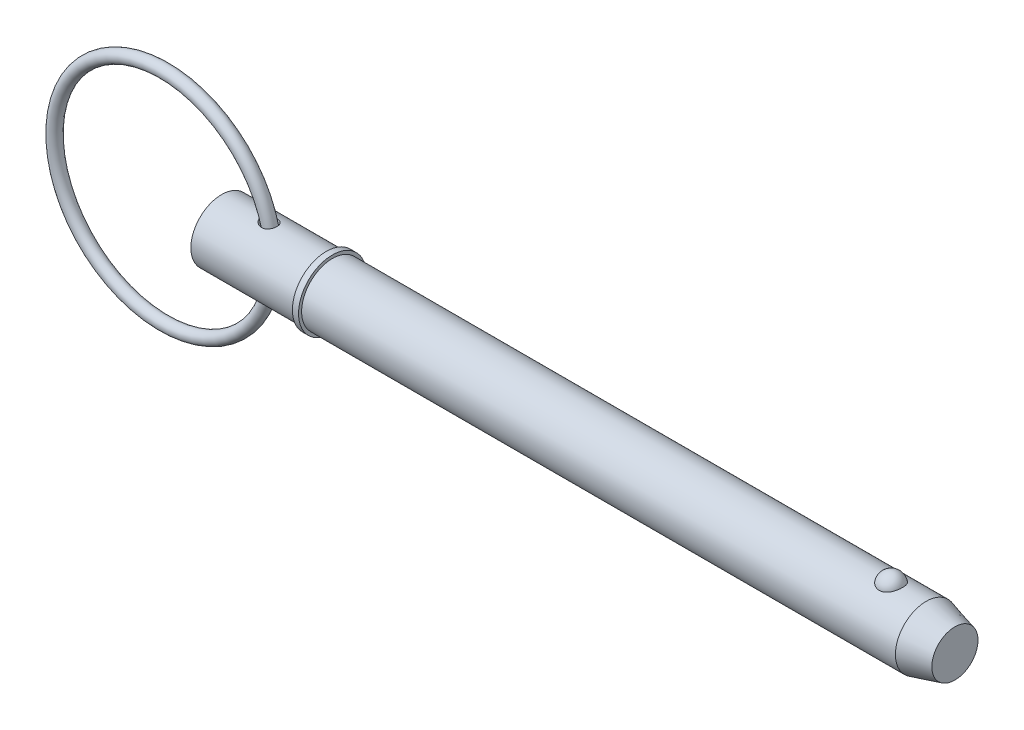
ISO-10303-21;
HEADER;
FILE_DESCRIPTION(('STEP AP214'),'2;1');
FILE_NAME('part.step','',(''),(''),'','','');
FILE_SCHEMA(('AUTOMOTIVE_DESIGN { 1 0 10303 214 1 1 1 1 }'));
ENDSEC;
DATA;
#1=APPLICATION_CONTEXT('core data for automotive mechanical design processes');
#2=APPLICATION_PROTOCOL_DEFINITION('international standard','automotive_design',2000,#1);
#3=PRODUCT_CONTEXT('',#1,'mechanical');
#4=PRODUCT('Part','Part','',(#3));
#5=PRODUCT_RELATED_PRODUCT_CATEGORY('part','',(#4));
#6=PRODUCT_DEFINITION_FORMATION('','',#4);
#7=PRODUCT_DEFINITION_CONTEXT('part definition',#1,'design');
#8=PRODUCT_DEFINITION('design','',#6,#7);
#9=PRODUCT_DEFINITION_SHAPE('','',#8);
#10=(LENGTH_UNIT() NAMED_UNIT(*) SI_UNIT(.MILLI.,.METRE.));
#11=(NAMED_UNIT(*) PLANE_ANGLE_UNIT() SI_UNIT($,.RADIAN.));
#12=(NAMED_UNIT(*) SI_UNIT($,.STERADIAN.) SOLID_ANGLE_UNIT());
#13=UNCERTAINTY_MEASURE_WITH_UNIT(LENGTH_MEASURE(1.E-05),#10,'distance_accuracy_value','');
#14=(GEOMETRIC_REPRESENTATION_CONTEXT(3) GLOBAL_UNCERTAINTY_ASSIGNED_CONTEXT((#13)) GLOBAL_UNIT_ASSIGNED_CONTEXT((#10,
#11,#12)) REPRESENTATION_CONTEXT('',''));
#15=CARTESIAN_POINT('',(0.,0.,0.));
#16=DIRECTION('',(0.,0.,1.));
#17=DIRECTION('',(1.,0.,0.));
#18=AXIS2_PLACEMENT_3D('',#15,#16,#17);
#19=CARTESIAN_POINT('',(-13.3805387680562,0.,0.));
#20=DIRECTION('',(0.,0.,1.));
#21=DIRECTION('',(1.,0.,0.));
#22=AXIS2_PLACEMENT_3D('',#19,#20,#21);
#23=TOROIDAL_SURFACE('',#22,25.4,1.429);
#24=CARTESIAN_POINT('',(13.4484612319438,0.,0.));
#25=VERTEX_POINT('',#24);
#26=VERTEX_LOOP('',#25);
#27=FACE_BOUND('',#26,.T.);
#28=ADVANCED_FACE('P0_F12',(#27),#23,.T.);
#29=CLOSED_SHELL('',(#28));
#30=MANIFOLD_SOLID_BREP('P0_B1',#29);
#31=CARTESIAN_POINT('',(0.,0.,0.));
#32=DIRECTION('',(1.,0.,0.));
#33=DIRECTION('',(0.,0.,-1.));
#34=AXIS2_PLACEMENT_3D('',#31,#32,#33);
#35=CYLINDRICAL_SURFACE('',#34,7.145);
#36=CARTESIAN_POINT('',(9.43029029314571,7.0820748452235,-0.946171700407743));
#37=CARTESIAN_POINT('',(9.49289741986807,7.07004660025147,-1.03619677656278));
#38=CARTESIAN_POINT('',(9.56370593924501,7.05703049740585,-1.12049617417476));
#39=CARTESIAN_POINT('',(9.71869321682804,7.03060933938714,-1.27585605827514));
#40=CARTESIAN_POINT('',(9.80290151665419,7.01720347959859,-1.34688652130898));
#41=CARTESIAN_POINT('',(9.98160385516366,6.99158714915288,-1.47408585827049));
#42=CARTESIAN_POINT('',(10.0760626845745,6.97937284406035,-1.53030346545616));
#43=CARTESIAN_POINT('',(10.2729508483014,6.95747410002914,-1.62697341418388));
#44=CARTESIAN_POINT('',(10.3753769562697,6.9477886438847,-1.66743209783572));
#45=CARTESIAN_POINT('',(10.5898946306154,6.93181594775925,-1.73266776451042));
#46=CARTESIAN_POINT('',(10.7022085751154,6.92567913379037,-1.75675727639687));
#47=CARTESIAN_POINT('',(10.9294935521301,6.91839634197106,-1.78523005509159));
#48=CARTESIAN_POINT('',(11.0444638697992,6.91724903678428,-1.78961856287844));
#49=CARTESIAN_POINT('',(11.2673249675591,6.92023954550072,-1.77801517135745));
#50=CARTESIAN_POINT('',(11.3752729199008,6.9241055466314,-1.7630715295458));
#51=CARTESIAN_POINT('',(11.5865707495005,6.93632220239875,-1.71437618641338));
#52=CARTESIAN_POINT('',(11.6899227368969,6.94467077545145,-1.68063321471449));
#53=CARTESIAN_POINT('',(11.8814537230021,6.96412118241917,-1.59802791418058));
#54=CARTESIAN_POINT('',(11.9701885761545,6.97498839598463,-1.55039425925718));
#55=CARTESIAN_POINT('',(12.1379548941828,6.99847346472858,-1.44066970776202));
#56=CARTESIAN_POINT('',(12.216987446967,7.01109112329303,-1.37858043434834));
#57=CARTESIAN_POINT('',(12.3614636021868,7.03632910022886,-1.24326778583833));
#58=CARTESIAN_POINT('',(12.4271729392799,7.04894297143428,-1.17032635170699));
#59=CARTESIAN_POINT('',(12.5455377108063,7.07306867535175,-1.01436746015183));
#60=CARTESIAN_POINT('',(12.5981928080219,7.08458047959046,-0.931349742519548));
#61=CARTESIAN_POINT('',(12.6896059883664,7.10535787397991,-0.75677050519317));
#62=CARTESIAN_POINT('',(12.7282356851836,7.11460247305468,-0.665139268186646));
#63=CARTESIAN_POINT('',(12.7900431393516,7.12971795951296,-0.476541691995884));
#64=CARTESIAN_POINT('',(12.8132203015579,7.13558871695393,-0.379575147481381));
#65=CARTESIAN_POINT('',(12.843715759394,7.14336270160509,-0.182249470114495));
#66=CARTESIAN_POINT('',(12.8509095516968,7.14523477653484,-0.0818698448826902));
#67=CARTESIAN_POINT('',(12.8489064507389,7.14471772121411,0.11871563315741));
#68=CARTESIAN_POINT('',(12.8397092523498,7.14232851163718,0.218921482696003));
#69=CARTESIAN_POINT('',(12.8051110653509,7.13353949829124,0.416446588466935));
#70=CARTESIAN_POINT('',(12.7796895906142,7.12713462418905,0.51376203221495));
#71=CARTESIAN_POINT('',(12.7132079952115,7.1110024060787,0.702607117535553));
#72=CARTESIAN_POINT('',(12.6721476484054,7.10127501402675,0.794136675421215));
#73=CARTESIAN_POINT('',(12.5754142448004,7.07957648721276,0.9686879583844));
#74=CARTESIAN_POINT('',(12.5197583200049,7.06760798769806,1.05171950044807));
#75=CARTESIAN_POINT('',(12.3951873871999,7.04275315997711,1.20699878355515));
#76=CARTESIAN_POINT('',(12.3262733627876,7.02986689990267,1.27924732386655));
#77=CARTESIAN_POINT('',(12.1775943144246,7.00473797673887,1.41035599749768));
#78=CARTESIAN_POINT('',(12.0979195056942,6.99249102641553,1.46931758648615));
#79=CARTESIAN_POINT('',(11.9295314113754,6.96991222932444,1.57295053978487));
#80=CARTESIAN_POINT('',(11.840819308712,6.9595801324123,1.61762377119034));
#81=CARTESIAN_POINT('',(11.6577653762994,6.94204625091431,1.69128599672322));
#82=CARTESIAN_POINT('',(11.5634812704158,6.93481718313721,1.72041226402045));
#83=CARTESIAN_POINT('',(11.3712731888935,6.92407027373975,1.76316901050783));
#84=CARTESIAN_POINT('',(11.2733489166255,6.92055273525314,1.7767982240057));
#85=CARTESIAN_POINT('',(11.0745092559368,6.91745053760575,1.78883853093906));
#86=CARTESIAN_POINT('',(10.9735737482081,6.91794816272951,1.7869312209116));
#87=CARTESIAN_POINT('',(10.7732766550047,6.92286647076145,1.76777696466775));
#88=CARTESIAN_POINT('',(10.6739155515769,6.92728833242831,1.75052540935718));
#89=CARTESIAN_POINT('',(10.4726907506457,6.93987626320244,1.69995986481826));
#90=CARTESIAN_POINT('',(10.3710860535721,6.94826759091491,1.66567223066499));
#91=CARTESIAN_POINT('',(10.1746512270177,6.96783543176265,1.5818155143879));
#92=CARTESIAN_POINT('',(10.0798244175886,6.97901329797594,1.53223900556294));
#93=CARTESIAN_POINT('',(9.89353725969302,7.00369413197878,1.41530336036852));
#94=CARTESIAN_POINT('',(9.80266896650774,7.01729943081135,1.34701798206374));
#95=CARTESIAN_POINT('',(9.63408859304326,7.0446567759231,1.19571433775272));
#96=CARTESIAN_POINT('',(9.55637809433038,7.05840883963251,1.11269430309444));
#97=CARTESIAN_POINT('',(9.41909992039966,7.083998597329,0.935821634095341));
#98=CARTESIAN_POINT('',(9.3591283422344,7.09587546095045,0.842290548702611));
#99=CARTESIAN_POINT('',(9.25811978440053,7.11649414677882,0.645207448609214));
#100=CARTESIAN_POINT('',(9.2170578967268,7.12524008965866,0.541668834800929));
#101=CARTESIAN_POINT('',(9.16044503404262,7.13745944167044,0.341322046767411));
#102=CARTESIAN_POINT('',(9.14237352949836,7.14144984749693,0.24525723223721));
#103=CARTESIAN_POINT('',(9.12416132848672,7.14547143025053,0.0513577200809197));
#104=CARTESIAN_POINT('',(9.12401221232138,7.14550446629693,-0.0464761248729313));
#105=CARTESIAN_POINT('',(9.14075660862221,7.14180686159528,-0.230866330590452));
#106=CARTESIAN_POINT('',(9.15598246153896,7.13844450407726,-0.317588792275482));
#107=CARTESIAN_POINT('',(9.20015637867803,7.1288735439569,-0.487231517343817));
#108=CARTESIAN_POINT('',(9.22909411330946,7.12266708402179,-0.570154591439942));
#109=CARTESIAN_POINT('',(9.2869632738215,7.11060500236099,-0.702183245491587));
#110=CARTESIAN_POINT('',(9.31233771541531,7.10538970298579,-0.752949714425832));
#111=CARTESIAN_POINT('',(9.36784352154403,7.09422889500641,-0.85170964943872));
#112=CARTESIAN_POINT('',(9.39797435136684,7.08828346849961,-0.899703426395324));
#113=CARTESIAN_POINT('',(9.43029029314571,7.0820748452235,-0.946171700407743));
#114=B_SPLINE_CURVE_WITH_KNOTS('',3,(#36,#37,#38,#39,#40,#41,#42,#43,#44,#45,#46,#47,#48,#49,
#50,#51,#52,#53,#54,#55,#56,#57,#58,#59,#60,#61,#62,#63,#64,#65,#66,#67,#68,#69,#70,#71,#72,#73,
#74,#75,#76,#77,#78,#79,#80,#81,#82,#83,#84,#85,#86,#87,#88,#89,#90,#91,#92,#93,#94,#95,#96,#97,
#98,#99,#100,#101,#102,#103,#104,#105,#106,#107,#108,#109,#110,#111,#112,#113),.UNSPECIFIED.,
.T.,.F.,(4,2,2,2,2,2,2,2,2,2,2,2,2,2,2,2,2,2,2,2,2,2,2,2,2,2,2,2,2,2,2,2,2,2,2,2,2,2,4),(0.,
0.330712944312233,0.662165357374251,0.992513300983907,1.32272815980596,1.66607248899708,
2.00932547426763,2.33472339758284,2.65997034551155,2.96236844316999,3.26473260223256,
3.56029376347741,3.85586255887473,4.15407251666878,4.45229395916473,4.75283038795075,
5.05337241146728,5.35429467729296,5.6552212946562,5.95579625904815,6.25634893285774,
6.55452242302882,6.85265693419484,7.14811357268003,7.44359434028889,7.74514565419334,
8.04678757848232,8.368090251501,8.68954924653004,9.03133562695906,9.37316306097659,
9.70647113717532,10.0393389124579,10.3311793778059,10.6228827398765,10.8860177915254,
11.1489549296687,11.3196783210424,11.4903825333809),.UNSPECIFIED.);
#115=CARTESIAN_POINT('',(9.43029029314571,7.0820748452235,-0.946171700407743));
#116=VERTEX_POINT('',#115);
#117=EDGE_CURVE('P1_E42',#116,#116,#114,.T.);
#118=ORIENTED_EDGE('',*,*,#117,.T.);
#119=EDGE_LOOP('',(#118));
#120=FACE_BOUND('',#119,.T.);
#121=CARTESIAN_POINT('',(0.,0.,0.));
#122=DIRECTION('',(1.,0.,0.));
#123=DIRECTION('',(0.,0.,-1.));
#124=AXIS2_PLACEMENT_3D('',#121,#122,#123);
#125=CIRCLE('',#124,7.145);
#126=CARTESIAN_POINT('',(0.,0.,-7.145));
#127=VERTEX_POINT('',#126);
#128=EDGE_CURVE('P1_E9',#127,#127,#125,.T.);
#129=ORIENTED_EDGE('',*,*,#128,.T.);
#130=EDGE_LOOP('',(#129));
#131=FACE_BOUND('',#130,.T.);
#132=CARTESIAN_POINT('',(24.271,0.,0.));
#133=DIRECTION('',(1.,0.,0.));
#134=DIRECTION('',(0.,0.,-1.));
#135=AXIS2_PLACEMENT_3D('',#132,#133,#134);
#136=CIRCLE('',#135,7.145);
#137=CARTESIAN_POINT('',(24.271,0.,-7.145));
#138=VERTEX_POINT('',#137);
#139=EDGE_CURVE('P1_E25',#138,#138,#136,.T.);
#140=ORIENTED_EDGE('',*,*,#139,.F.);
#141=EDGE_LOOP('',(#140));
#142=FACE_BOUND('',#141,.T.);
#143=CARTESIAN_POINT('',(9.43029029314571,-7.0820748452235,-0.946171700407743));
#144=CARTESIAN_POINT('',(9.37760063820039,-7.09219753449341,-0.870403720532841));
#145=CARTESIAN_POINT('',(9.33068640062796,-7.10162619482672,-0.790535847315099));
#146=CARTESIAN_POINT('',(9.25028000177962,-7.11818229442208,-0.624083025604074));
#147=CARTESIAN_POINT('',(9.21677847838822,-7.12531133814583,-0.537502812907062));
#148=CARTESIAN_POINT('',(9.16475883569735,-7.13651886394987,-0.359324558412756));
#149=CARTESIAN_POINT('',(9.14630423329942,-7.14058440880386,-0.267706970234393));
#150=CARTESIAN_POINT('',(9.12573334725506,-7.14512216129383,-0.0825612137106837));
#151=CARTESIAN_POINT('',(9.12361335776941,-7.1455951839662,0.0109665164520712));
#152=CARTESIAN_POINT('',(9.13548667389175,-7.14296952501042,0.191627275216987));
#153=CARTESIAN_POINT('',(9.14858103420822,-7.14007009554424,0.278824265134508));
#154=CARTESIAN_POINT('',(9.18869656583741,-7.1313430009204,0.449782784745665));
#155=CARTESIAN_POINT('',(9.21571947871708,-7.1255149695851,0.533543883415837));
#156=CARTESIAN_POINT('',(9.282939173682,-7.11140544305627,0.696984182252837));
#157=CARTESIAN_POINT('',(9.32334793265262,-7.10308469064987,0.7765721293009));
#158=CARTESIAN_POINT('',(9.41555290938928,-7.08481187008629,0.928623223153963));
#159=CARTESIAN_POINT('',(9.4673531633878,-7.07485922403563,1.00108383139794));
#160=CARTESIAN_POINT('',(9.58690514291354,-7.05302654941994,1.14530893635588));
#161=CARTESIAN_POINT('',(9.65578345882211,-7.04105486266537,1.21612477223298));
#162=CARTESIAN_POINT('',(9.80342908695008,-7.01727063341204,1.34660507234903));
#163=CARTESIAN_POINT('',(9.88220203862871,-7.00545818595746,1.40626312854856));
#164=CARTESIAN_POINT('',(10.0573217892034,-6.98177399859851,1.51973713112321));
#165=CARTESIAN_POINT('',(10.1546474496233,-6.9700532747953,1.57208037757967));
#166=CARTESIAN_POINT('',(10.3567277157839,-6.94950828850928,1.66055104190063));
#167=CARTESIAN_POINT('',(10.4614845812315,-6.94068491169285,1.69667350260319));
#168=CARTESIAN_POINT('',(10.6792116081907,-6.92685379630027,1.75230777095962));
#169=CARTESIAN_POINT('',(10.7923373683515,-6.92197732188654,1.77125049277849));
#170=CARTESIAN_POINT('',(11.0202699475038,-6.91736328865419,1.78919210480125));
#171=CARTESIAN_POINT('',(11.1350759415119,-6.91762328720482,1.78820047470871));
#172=CARTESIAN_POINT('',(11.355627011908,-6.92328130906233,1.76615765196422));
#173=CARTESIAN_POINT('',(11.4615007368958,-6.92836826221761,1.74632083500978));
#174=CARTESIAN_POINT('',(11.6678083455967,-6.94272508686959,1.68833625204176));
#175=CARTESIAN_POINT('',(11.7682443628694,-6.9519933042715,1.65019572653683));
#176=CARTESIAN_POINT('',(11.9539217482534,-6.97285816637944,1.55957439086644));
#177=CARTESIAN_POINT('',(12.0397280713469,-6.98426147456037,1.50820229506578));
#178=CARTESIAN_POINT('',(12.2011249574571,-7.00842344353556,1.39160266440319));
#179=CARTESIAN_POINT('',(12.276716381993,-7.0211819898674,1.32637629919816));
#180=CARTESIAN_POINT('',(12.4144868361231,-7.04639315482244,1.18508369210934));
#181=CARTESIAN_POINT('',(12.4768620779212,-7.05884739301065,1.10920872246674));
#182=CARTESIAN_POINT('',(12.5881779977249,-7.08230185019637,0.947973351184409));
#183=CARTESIAN_POINT('',(12.6371182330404,-7.09330202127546,0.862612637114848));
#184=CARTESIAN_POINT('',(12.7208404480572,-7.11277016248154,0.68387168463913));
#185=CARTESIAN_POINT('',(12.7554736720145,-7.12121129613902,0.590418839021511));
#186=CARTESIAN_POINT('',(12.8090653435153,-7.13450309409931,0.398877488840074));
#187=CARTESIAN_POINT('',(12.8280232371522,-7.13935363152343,0.300788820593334));
#188=CARTESIAN_POINT('',(12.8499077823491,-7.14496695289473,0.102058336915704));
#189=CARTESIAN_POINT('',(12.8527265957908,-7.14570223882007,0.00140385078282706));
#190=CARTESIAN_POINT('',(12.8419792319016,-7.14293198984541,-0.198968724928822));
#191=CARTESIAN_POINT('',(12.8284127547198,-7.13942637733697,-0.298686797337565));
#192=CARTESIAN_POINT('',(12.7851853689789,-7.12854635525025,-0.494442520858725));
#193=CARTESIAN_POINT('',(12.7555107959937,-7.12116866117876,-0.590476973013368));
#194=CARTESIAN_POINT('',(12.6807437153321,-7.10334272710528,-0.776042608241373));
#195=CARTESIAN_POINT('',(12.6356510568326,-7.09289445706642,-0.865573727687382));
#196=CARTESIAN_POINT('',(12.5312128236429,-7.07009703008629,-1.03541867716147));
#197=CARTESIAN_POINT('',(12.4718917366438,-7.0577511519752,-1.11574799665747));
#198=CARTESIAN_POINT('',(12.3404461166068,-7.03252701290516,-1.26504204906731));
#199=CARTESIAN_POINT('',(12.2683227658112,-7.01964880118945,-1.3340078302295));
#200=CARTESIAN_POINT('',(12.1139052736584,-6.99493588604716,-1.45803732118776));
#201=CARTESIAN_POINT('',(12.031708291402,-6.98309284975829,-1.51322032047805));
#202=CARTESIAN_POINT('',(11.858962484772,-6.96164945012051,-1.60900039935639));
#203=CARTESIAN_POINT('',(11.7684146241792,-6.95204882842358,-1.6495991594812));
#204=CARTESIAN_POINT('',(11.5822744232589,-6.93618392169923,-1.71508374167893));
#205=CARTESIAN_POINT('',(11.4867225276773,-6.92989640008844,-1.74007923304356));
#206=CARTESIAN_POINT('',(11.292703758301,-6.92114809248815,-1.77455680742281));
#207=CARTESIAN_POINT('',(11.1942365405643,-6.91868775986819,-1.7840370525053));
#208=CARTESIAN_POINT('',(10.9943797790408,-6.91771041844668,-1.78782317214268));
#209=CARTESIAN_POINT('',(10.8929824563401,-6.9193005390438,-1.78171679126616));
#210=CARTESIAN_POINT('',(10.6924353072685,-6.92632816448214,-1.75419409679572));
#211=CARTESIAN_POINT('',(10.5932861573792,-6.93176681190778,-1.73277323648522));
#212=CARTESIAN_POINT('',(10.3927770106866,-6.94630717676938,-1.67356884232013));
#213=CARTESIAN_POINT('',(10.2917367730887,-6.95563581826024,-1.63475796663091));
#214=CARTESIAN_POINT('',(10.0971768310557,-6.97681957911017,-1.54184188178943));
#215=CARTESIAN_POINT('',(10.0036623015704,-6.9886764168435,-1.48772626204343));
#216=CARTESIAN_POINT('',(9.82098935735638,-7.01440230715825,-1.36146688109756));
#217=CARTESIAN_POINT('',(9.73247440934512,-7.0283510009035,-1.28840361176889));
#218=CARTESIAN_POINT('',(9.56978695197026,-7.05591334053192,-1.12770855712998));
#219=CARTESIAN_POINT('',(9.49560170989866,-7.06952727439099,-1.0400898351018));
#220=CARTESIAN_POINT('',(9.43029029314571,-7.0820748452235,-0.946171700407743));
#221=B_SPLINE_CURVE_WITH_KNOTS('',3,(#143,#144,#145,#146,#147,#148,#149,#150,#151,#152,#153,
#154,#155,#156,#157,#158,#159,#160,#161,#162,#163,#164,#165,#166,#167,#168,#169,#170,#171,#172,
#173,#174,#175,#176,#177,#178,#179,#180,#181,#182,#183,#184,#185,#186,#187,#188,#189,#190,#191,
#192,#193,#194,#195,#196,#197,#198,#199,#200,#201,#202,#203,#204,#205,#206,#207,#208,#209,#210,
#211,#212,#213,#214,#215,#216,#217,#218,#219,#220),.UNSPECIFIED.,.T.,.F.,(4,2,2,2,2,2,2,2,2,2,2,
2,2,2,2,2,2,2,2,2,2,2,2,2,2,2,2,2,2,2,2,2,2,2,2,2,2,2,4),(0.,0.278197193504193,
0.556199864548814,0.835370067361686,1.11447693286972,1.37789669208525,1.64134939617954,
1.9091912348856,2.17712812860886,2.4744625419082,2.77196719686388,3.10386520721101,
3.43586457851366,3.77849767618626,4.1209678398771,4.44276705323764,4.76443907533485,
5.06494526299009,5.36542609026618,5.6610728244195,5.95672929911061,6.25538683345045,
6.5540549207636,6.85471634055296,7.15538326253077,7.45630563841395,7.75723095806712,
8.05764204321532,8.35802540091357,8.65571107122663,8.95336242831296,9.24889743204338,
9.54446744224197,9.84793560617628,10.1514939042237,10.4760045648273,10.8007364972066,
11.1458836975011,11.4907227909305),.UNSPECIFIED.);
#222=CARTESIAN_POINT('',(9.43029029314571,-7.0820748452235,-0.946171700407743));
#223=VERTEX_POINT('',#222);
#224=EDGE_CURVE('P1_E17',#223,#223,#221,.T.);
#225=ORIENTED_EDGE('',*,*,#224,.T.);
#226=EDGE_LOOP('',(#225));
#227=FACE_BOUND('',#226,.T.);
#228=ADVANCED_FACE('P1_F13',(#120,#131,#142,#227),#35,.T.);
#229=CARTESIAN_POINT('',(0.,0.,0.));
#230=DIRECTION('',(1.,0.,0.));
#231=DIRECTION('',(0.,0.,-1.));
#232=AXIS2_PLACEMENT_3D('',#229,#230,#231);
#233=CYLINDRICAL_SURFACE('',#232,7.145);
#234=CARTESIAN_POINT('',(163.48362424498,0.,0.));
#235=DIRECTION('',(1.,0.,0.));
#236=DIRECTION('',(0.,0.,-1.));
#237=AXIS2_PLACEMENT_3D('',#234,#235,#236);
#238=CIRCLE('',#237,7.145);
#239=CARTESIAN_POINT('',(163.48362424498,0.,-7.145));
#240=VERTEX_POINT('',#239);
#241=EDGE_CURVE('P1_E99',#240,#240,#238,.T.);
#242=ORIENTED_EDGE('',*,*,#241,.F.);
#243=EDGE_LOOP('',(#242));
#244=FACE_BOUND('',#243,.T.);
#245=CARTESIAN_POINT('',(25.7,0.,0.));
#246=DIRECTION('',(1.,0.,0.));
#247=DIRECTION('',(0.,0.,-1.));
#248=AXIS2_PLACEMENT_3D('',#245,#246,#247);
#249=CIRCLE('',#248,7.145);
#250=CARTESIAN_POINT('',(25.7,0.,-7.145));
#251=VERTEX_POINT('',#250);
#252=EDGE_CURVE('P1_E96',#251,#251,#249,.T.);
#253=ORIENTED_EDGE('',*,*,#252,.T.);
#254=EDGE_LOOP('',(#253));
#255=FACE_BOUND('',#254,.T.);
#256=CARTESIAN_POINT('',(155.339503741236,6.60328629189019,2.72903557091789));
#257=CARTESIAN_POINT('',(155.198315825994,6.60329644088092,2.72902496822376));
#258=CARTESIAN_POINT('',(155.056883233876,6.60799490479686,2.71772840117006));
#259=CARTESIAN_POINT('',(154.777955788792,6.62628236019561,2.67281935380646));
#260=CARTESIAN_POINT('',(154.640472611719,6.63989534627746,2.63914664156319));
#261=CARTESIAN_POINT('',(154.373889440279,6.67440775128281,2.55059642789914));
#262=CARTESIAN_POINT('',(154.244768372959,6.69528793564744,2.49577486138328));
#263=CARTESIAN_POINT('',(153.997869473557,6.7420558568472,2.36651799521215));
#264=CARTESIAN_POINT('',(153.880086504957,6.76794130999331,2.29209163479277));
#265=CARTESIAN_POINT('',(153.65516710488,6.82286177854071,2.12312937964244));
#266=CARTESIAN_POINT('',(153.548440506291,6.85196655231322,2.02807107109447));
#267=CARTESIAN_POINT('',(153.351918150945,6.90970232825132,1.82167822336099));
#268=CARTESIAN_POINT('',(153.262127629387,6.93833318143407,1.7103386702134));
#269=CARTESIAN_POINT('',(153.097667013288,6.99351679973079,1.46891951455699));
#270=CARTESIAN_POINT('',(153.023844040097,7.01992110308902,1.33822781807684));
#271=CARTESIAN_POINT('',(152.898088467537,7.06643385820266,1.06566567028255));
#272=CARTESIAN_POINT('',(152.84615735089,7.08654188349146,0.923794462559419));
#273=CARTESIAN_POINT('',(152.764732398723,7.11862399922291,0.630993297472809));
#274=CARTESIAN_POINT('',(152.735516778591,7.13049704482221,0.479974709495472));
#275=CARTESIAN_POINT('',(152.701174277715,7.14449484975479,0.174782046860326));
#276=CARTESIAN_POINT('',(152.696046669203,7.14661990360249,0.0206080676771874));
#277=CARTESIAN_POINT('',(152.709938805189,7.14092465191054,-0.285506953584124));
#278=CARTESIAN_POINT('',(152.728810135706,7.1331654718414,-0.43745589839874));
#279=CARTESIAN_POINT('',(152.790062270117,7.10859076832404,-0.735778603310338));
#280=CARTESIAN_POINT('',(152.832443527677,7.0917750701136,-0.882152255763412));
#281=CARTESIAN_POINT('',(152.939934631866,7.05076716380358,-1.16543149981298));
#282=CARTESIAN_POINT('',(153.005075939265,7.02656475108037,-1.30232366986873));
#283=CARTESIAN_POINT('',(153.156759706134,6.97329145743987,-1.56265907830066));
#284=CARTESIAN_POINT('',(153.243303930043,6.94422017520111,-1.68610120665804));
#285=CARTESIAN_POINT('',(153.436465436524,6.88415108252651,-1.91671004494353));
#286=CARTESIAN_POINT('',(153.543180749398,6.85314438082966,-2.02379244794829));
#287=CARTESIAN_POINT('',(153.773974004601,6.7928206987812,-2.2178743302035));
#288=CARTESIAN_POINT('',(153.898050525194,6.76350358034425,-2.30487545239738));
#289=CARTESIAN_POINT('',(154.157678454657,6.71060580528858,-2.45458647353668));
#290=CARTESIAN_POINT('',(154.292938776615,6.68691885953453,-2.51776240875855));
#291=CARTESIAN_POINT('',(154.573277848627,6.64741247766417,-2.62030218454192));
#292=CARTESIAN_POINT('',(154.718352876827,6.63159007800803,-2.65967499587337));
#293=CARTESIAN_POINT('',(155.006347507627,6.61038594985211,-2.71193301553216));
#294=CARTESIAN_POINT('',(155.14900807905,6.6045188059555,-2.72605165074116));
#295=CARTESIAN_POINT('',(155.43480047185,6.60240611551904,-2.73116688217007));
#296=CARTESIAN_POINT('',(155.577932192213,6.60615862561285,-2.72216814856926));
#297=CARTESIAN_POINT('',(155.855848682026,6.62256094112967,-2.68200435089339));
#298=CARTESIAN_POINT('',(155.990754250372,6.63492533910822,-2.65154998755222));
#299=CARTESIAN_POINT('',(156.25332009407,6.66687445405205,-2.57015684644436));
#300=CARTESIAN_POINT('',(156.38097978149,6.68645975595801,-2.51921640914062));
#301=CARTESIAN_POINT('',(156.628577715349,6.73127274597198,-2.39693610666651));
#302=CARTESIAN_POINT('',(156.748287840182,6.75661381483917,-2.32517694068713));
#303=CARTESIAN_POINT('',(156.974159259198,6.81006003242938,-2.16363812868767));
#304=CARTESIAN_POINT('',(157.080317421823,6.83816581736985,-2.0738543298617));
#305=CARTESIAN_POINT('',(157.281862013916,6.89580469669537,-1.8735723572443));
#306=CARTESIAN_POINT('',(157.376440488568,6.92533863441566,-1.76226074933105));
#307=CARTESIAN_POINT('',(157.546332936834,6.98139526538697,-1.52511696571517));
#308=CARTESIAN_POINT('',(157.621643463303,7.00791741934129,-1.39928219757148));
#309=CARTESIAN_POINT('',(157.753595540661,7.0560762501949,-1.13215977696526));
#310=CARTESIAN_POINT('',(157.809568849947,7.07753119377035,-0.990508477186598));
#311=CARTESIAN_POINT('',(157.898296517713,7.11222355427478,-0.699154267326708));
#312=CARTESIAN_POINT('',(157.931050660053,7.12546089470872,-0.549451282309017));
#313=CARTESIAN_POINT('',(157.972689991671,7.1423758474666,-0.246120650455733));
#314=CARTESIAN_POINT('',(157.981558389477,7.14604673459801,-0.0924903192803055));
#315=CARTESIAN_POINT('',(157.975194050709,7.14343510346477,0.214181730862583));
#316=CARTESIAN_POINT('',(157.959961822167,7.13715279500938,0.367223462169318));
#317=CARTESIAN_POINT('',(157.905845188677,7.11532948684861,0.667595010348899));
#318=CARTESIAN_POINT('',(157.867077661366,7.09983424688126,0.81494925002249));
#319=CARTESIAN_POINT('',(157.766770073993,7.06119140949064,1.10063221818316));
#320=CARTESIAN_POINT('',(157.705228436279,7.03804328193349,1.23896032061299));
#321=CARTESIAN_POINT('',(157.560207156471,6.98632429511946,1.50352300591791));
#322=CARTESIAN_POINT('',(157.476606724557,6.95772382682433,1.62968561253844));
#323=CARTESIAN_POINT('',(157.28938046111,6.89823072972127,1.86554304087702));
#324=CARTESIAN_POINT('',(157.185755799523,6.86733823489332,1.97523882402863));
#325=CARTESIAN_POINT('',(156.961076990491,6.80676456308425,2.174822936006));
#326=CARTESIAN_POINT('',(156.840067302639,6.7770805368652,2.26476035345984));
#327=CARTESIAN_POINT('',(156.583340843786,6.72230501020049,2.42252989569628));
#328=CARTESIAN_POINT('',(156.44761851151,6.69721525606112,2.49035362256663));
#329=CARTESIAN_POINT('',(156.170402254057,6.65552591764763,2.5996764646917));
#330=CARTESIAN_POINT('',(156.029281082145,6.63865794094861,2.64202017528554));
#331=CARTESIAN_POINT('',(155.741444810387,6.61425039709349,2.70255841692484));
#332=CARTESIAN_POINT('',(155.594748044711,6.60668259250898,2.72082606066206));
#333=CARTESIAN_POINT('',(155.411679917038,6.6035875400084,2.72830331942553));
#334=CARTESIAN_POINT('',(155.375599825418,6.60328369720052,2.72903828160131));
#335=CARTESIAN_POINT('',(155.339503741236,6.60328629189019,2.72903557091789));
#336=B_SPLINE_CURVE_WITH_KNOTS('',3,(#256,#257,#258,#259,#260,#261,#262,#263,#264,#265,#266,
#267,#268,#269,#270,#271,#272,#273,#274,#275,#276,#277,#278,#279,#280,#281,#282,#283,#284,#285,
#286,#287,#288,#289,#290,#291,#292,#293,#294,#295,#296,#297,#298,#299,#300,#301,#302,#303,#304,
#305,#306,#307,#308,#309,#310,#311,#312,#313,#314,#315,#316,#317,#318,#319,#320,#321,#322,#323,
#324,#325,#326,#327,#328,#329,#330,#331,#332,#333,#334,#335),.UNSPECIFIED.,.T.,.F.,(4,2,2,2,2,2,
2,2,2,2,2,2,2,2,2,2,2,2,2,2,2,2,2,2,2,2,2,2,2,2,2,2,2,2,2,2,2,2,2,4),(0.,0.423468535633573,
0.848081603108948,1.27157926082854,1.69488414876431,2.13051395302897,2.5662781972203,
3.02136706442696,3.47648674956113,3.93709649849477,4.39769233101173,4.85545355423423,
5.31322361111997,5.77162895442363,6.23007210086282,6.69080337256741,7.15149693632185,
7.60264329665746,8.05361952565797,8.48189729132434,8.91008854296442,9.3247252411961,
9.73939553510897,10.1630783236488,10.5868588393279,11.0319070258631,11.4770347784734,
11.9362874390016,12.3955443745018,12.8551240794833,13.3146940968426,13.7720003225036,
14.2293382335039,14.6892343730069,15.1491036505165,15.6078171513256,16.0667046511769,
16.5093965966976,16.950741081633,17.0590049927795),.UNSPECIFIED.);
#337=CARTESIAN_POINT('',(155.339503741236,6.60328629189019,2.72903557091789));
#338=VERTEX_POINT('',#337);
#339=EDGE_CURVE('P1_E34',#338,#338,#336,.T.);
#340=ORIENTED_EDGE('',*,*,#339,.T.);
#341=EDGE_LOOP('',(#340));
#342=FACE_BOUND('',#341,.T.);
#343=ADVANCED_FACE('P1_F46',(#244,#255,#342),#233,.T.);
#344=CARTESIAN_POINT('',(0.,0.,0.));
#345=DIRECTION('',(-1.,0.,0.));
#346=DIRECTION('',(0.,0.,1.));
#347=AXIS2_PLACEMENT_3D('',#344,#345,#346);
#348=PLANE('',#347);
#349=ORIENTED_EDGE('',*,*,#128,.F.);
#350=EDGE_LOOP('',(#349));
#351=FACE_BOUND('',#350,.T.);
#352=ADVANCED_FACE('P1_F15',(#351),#348,.T.);
#353=CARTESIAN_POINT('',(24.271,7.145,0.));
#354=DIRECTION('',(-1.,0.,0.));
#355=DIRECTION('',(0.,0.,1.));
#356=AXIS2_PLACEMENT_3D('',#353,#354,#355);
#357=PLANE('',#356);
#358=ORIENTED_EDGE('',*,*,#139,.T.);
#359=EDGE_LOOP('',(#358));
#360=FACE_BOUND('',#359,.T.);
#361=CARTESIAN_POINT('',(24.271,0.,0.));
#362=DIRECTION('',(1.,0.,0.));
#363=DIRECTION('',(0.,0.,-1.));
#364=AXIS2_PLACEMENT_3D('',#361,#362,#363);
#365=CIRCLE('',#364,7.8595);
#366=CARTESIAN_POINT('',(24.271,0.,-7.8595));
#367=VERTEX_POINT('',#366);
#368=EDGE_CURVE('P1_E30',#367,#367,#365,.T.);
#369=ORIENTED_EDGE('',*,*,#368,.F.);
#370=EDGE_LOOP('',(#369));
#371=FACE_BOUND('',#370,.T.);
#372=ADVANCED_FACE('P1_F81',(#360,#371),#357,.T.);
#373=CARTESIAN_POINT('',(0.,0.,0.));
#374=DIRECTION('',(1.,0.,0.));
#375=DIRECTION('',(0.,0.,-1.));
#376=AXIS2_PLACEMENT_3D('',#373,#374,#375);
#377=CYLINDRICAL_SURFACE('',#376,7.8595);
#378=ORIENTED_EDGE('',*,*,#368,.T.);
#379=EDGE_LOOP('',(#378));
#380=FACE_BOUND('',#379,.T.);
#381=CARTESIAN_POINT('',(25.7,0.,0.));
#382=DIRECTION('',(1.,0.,0.));
#383=DIRECTION('',(0.,0.,-1.));
#384=AXIS2_PLACEMENT_3D('',#381,#382,#383);
#385=CIRCLE('',#384,7.8595);
#386=CARTESIAN_POINT('',(25.7,0.,-7.8595));
#387=VERTEX_POINT('',#386);
#388=EDGE_CURVE('P1_E95',#387,#387,#385,.T.);
#389=ORIENTED_EDGE('',*,*,#388,.F.);
#390=EDGE_LOOP('',(#389));
#391=FACE_BOUND('',#390,.T.);
#392=ADVANCED_FACE('P1_F68',(#380,#391),#377,.T.);
#393=CARTESIAN_POINT('',(25.7,7.8595,0.));
#394=DIRECTION('',(1.,0.,0.));
#395=DIRECTION('',(0.,0.,-1.));
#396=AXIS2_PLACEMENT_3D('',#393,#394,#395);
#397=PLANE('',#396);
#398=ORIENTED_EDGE('',*,*,#388,.T.);
#399=EDGE_LOOP('',(#398));
#400=FACE_BOUND('',#399,.T.);
#401=ORIENTED_EDGE('',*,*,#252,.F.);
#402=EDGE_LOOP('',(#401));
#403=FACE_BOUND('',#402,.T.);
#404=ADVANCED_FACE('P1_F62',(#400,#403),#397,.T.);
#405=CARTESIAN_POINT('',(170.15,0.,0.));
#406=DIRECTION('',(-1.,0.,0.));
#407=DIRECTION('',(0.,0.,1.));
#408=AXIS2_PLACEMENT_3D('',#405,#406,#407);
#409=CONICAL_SURFACE('',#408,5.35875000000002,0.261799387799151);
#410=ORIENTED_EDGE('',*,*,#241,.T.);
#411=EDGE_LOOP('',(#410));
#412=FACE_BOUND('',#411,.T.);
#413=CARTESIAN_POINT('',(170.15,0.,0.));
#414=DIRECTION('',(1.,0.,0.));
#415=DIRECTION('',(0.,0.,-1.));
#416=AXIS2_PLACEMENT_3D('',#413,#414,#415);
#417=CIRCLE('',#416,5.35875000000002);
#418=CARTESIAN_POINT('',(170.15,0.,-5.35875000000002));
#419=VERTEX_POINT('',#418);
#420=EDGE_CURVE('P1_E41',#419,#419,#417,.T.);
#421=ORIENTED_EDGE('',*,*,#420,.F.);
#422=EDGE_LOOP('',(#421));
#423=FACE_BOUND('',#422,.T.);
#424=ADVANCED_FACE('P1_F59',(#412,#423),#409,.T.);
#425=CARTESIAN_POINT('',(170.15,5.35875000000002,0.));
#426=DIRECTION('',(1.,0.,0.));
#427=DIRECTION('',(0.,0.,-1.));
#428=AXIS2_PLACEMENT_3D('',#425,#426,#427);
#429=PLANE('',#428);
#430=ORIENTED_EDGE('',*,*,#420,.T.);
#431=EDGE_LOOP('',(#430));
#432=FACE_BOUND('',#431,.T.);
#433=ADVANCED_FACE('P1_F55',(#432),#429,.T.);
#434=CARTESIAN_POINT('',(155.339503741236,6.4305,0.));
#435=DIRECTION('',(-1.,0.,0.));
#436=DIRECTION('',(0.,1.,0.));
#437=AXIS2_PLACEMENT_3D('',#434,#435,#436);
#438=SPHERICAL_SURFACE('',#437,2.73450000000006);
#439=ORIENTED_EDGE('',*,*,#339,.F.);
#440=EDGE_LOOP('',(#439));
#441=FACE_BOUND('',#440,.T.);
#442=ADVANCED_FACE('P1_F50',(#441),#438,.T.);
#443=CARTESIAN_POINT('',(-13.3805387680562,0.,0.));
#444=DIRECTION('',(0.,0.,1.));
#445=DIRECTION('',(1.,0.,0.));
#446=AXIS2_PLACEMENT_3D('',#443,#444,#445);
#447=TOROIDAL_SURFACE('',#446,25.4,1.78625);
#448=ORIENTED_EDGE('',*,*,#224,.F.);
#449=EDGE_LOOP('',(#448));
#450=FACE_BOUND('',#449,.T.);
#451=ORIENTED_EDGE('',*,*,#117,.F.);
#452=EDGE_LOOP('',(#451));
#453=FACE_BOUND('',#452,.T.);
#454=ADVANCED_FACE('P1_F54',(#450,#453),#447,.F.);
#455=CLOSED_SHELL('',(#228,#343,#352,#372,#392,#404,#424,#433,#442,#454));
#456=MANIFOLD_SOLID_BREP('P1_B1',#455);
#457=ADVANCED_BREP_SHAPE_REPRESENTATION('',(#18,#30,#456),#14);
#458=SHAPE_DEFINITION_REPRESENTATION(#9,#457);
ENDSEC;
END-ISO-10303-21;
